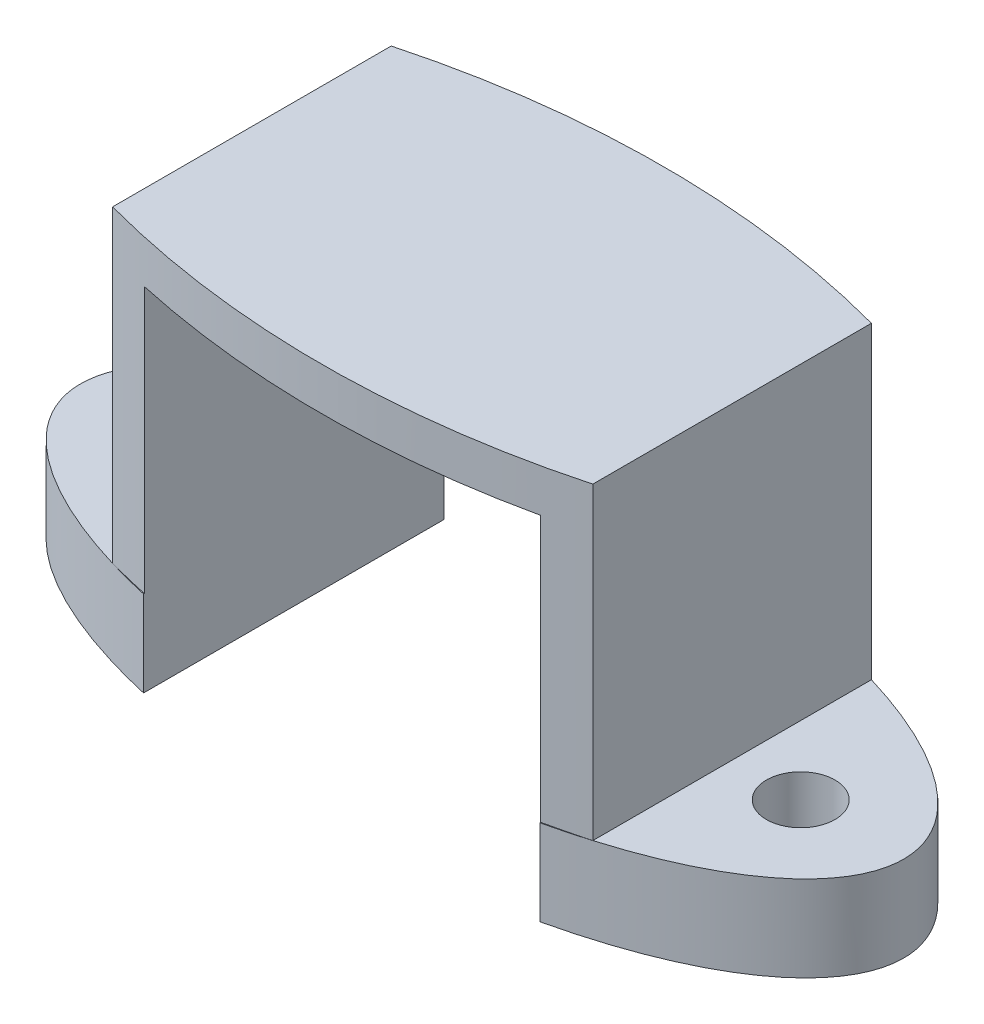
from build123d import *

# Parameters (mm, degrees)
SKETCH2_RX          = 12
SKETCH2_RY          = 5
BOSS_EXTRUDE1_DEPTH = 2.5
SKETCH3_R           = 1
CUT_EXTRUDE1_DEPTH  = 2.5
BOSS_EXTRUDE3_DEPTH = 9
SKETCH11_W          = 11.55
SKETCH11_H          = 10.25
CUT_EXTRUDE3_DEPTH  = 20


with BuildPart() as part:
    # Sketch2 → Boss-Extrude1 (new body)
    with BuildSketch(Plane(origin=(0, 0, 0), x_dir=(1, 0, 0), z_dir=(0, 1, 0))):
        with Locations((0, 0)):
            Ellipse(SKETCH2_RX, SKETCH2_RY)
    extrude(amount=BOSS_EXTRUDE1_DEPTH)

    # Sketch3 → Cut-Extrude1 (cut)
    with BuildSketch(Plane(origin=(0, 2.5, 0), x_dir=(1, 0, 0), z_dir=(0, 1, 0))):
        with Locations(Location((9, 0, 0), (0, 0, 270))):
            Circle(SKETCH3_R)
        with Locations(Location((-9, 0, 0), (0, 0, 270))):
            Circle(SKETCH3_R)
    extrude(amount=-CUT_EXTRUDE1_DEPTH, mode=Mode.SUBTRACT)

    # Sketch10 → Boss-Extrude3 (add)
    with BuildSketch(Plane(origin=(0, 2.5, 0), x_dir=(1, 0, 0), z_dir=(0, 1, 0))):
        with BuildLine():
            Line((-7, -4.06116431), (-7, 4.06116431))
            ThreePointArc((-7, 4.06116431), (0, 4.987807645), (7, 4.06116431))
            Line((7, 4.06116431), (7, -4.06116431))
            ThreePointArc((7, -4.06116431), (0, -4.98780129), (-7, -4.06116431))
        make_face()
    extrude(amount=BOSS_EXTRUDE3_DEPTH)

    # Sketch11 → Cut-Extrude3 (cut)
    with BuildSketch(Plane.XY.offset(10)):
        with Locations((0, 5.125)):
            Rectangle(SKETCH11_W, SKETCH11_H)
    extrude(amount=-CUT_EXTRUDE3_DEPTH, mode=Mode.SUBTRACT)


solid = part.part
